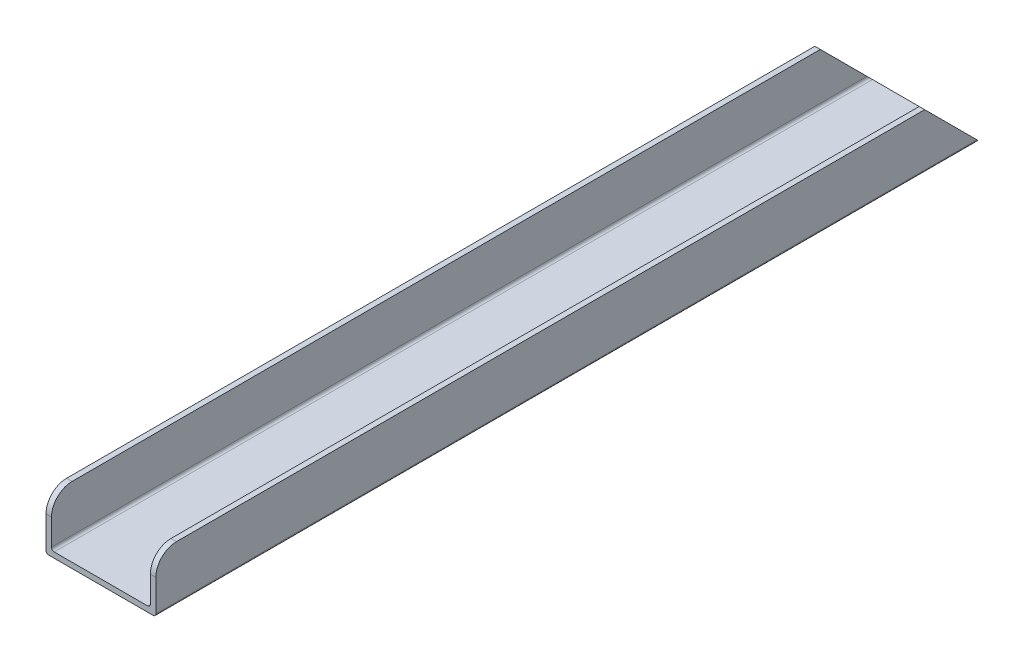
ISO-10303-21;
HEADER;
FILE_DESCRIPTION(('STEP AP214'),'2;1');
FILE_NAME('part.step','',(''),(''),'','','');
FILE_SCHEMA(('AUTOMOTIVE_DESIGN { 1 0 10303 214 1 1 1 1 }'));
ENDSEC;
DATA;
#1=APPLICATION_CONTEXT('core data for automotive mechanical design processes');
#2=APPLICATION_PROTOCOL_DEFINITION('international standard','automotive_design',2000,#1);
#3=PRODUCT_CONTEXT('',#1,'mechanical');
#4=PRODUCT('Part','Part','',(#3));
#5=PRODUCT_RELATED_PRODUCT_CATEGORY('part','',(#4));
#6=PRODUCT_DEFINITION_FORMATION('','',#4);
#7=PRODUCT_DEFINITION_CONTEXT('part definition',#1,'design');
#8=PRODUCT_DEFINITION('design','',#6,#7);
#9=PRODUCT_DEFINITION_SHAPE('','',#8);
#10=(LENGTH_UNIT() NAMED_UNIT(*) SI_UNIT(.MILLI.,.METRE.));
#11=(NAMED_UNIT(*) PLANE_ANGLE_UNIT() SI_UNIT($,.RADIAN.));
#12=(NAMED_UNIT(*) SI_UNIT($,.STERADIAN.) SOLID_ANGLE_UNIT());
#13=UNCERTAINTY_MEASURE_WITH_UNIT(LENGTH_MEASURE(1.E-05),#10,'distance_accuracy_value','');
#14=(GEOMETRIC_REPRESENTATION_CONTEXT(3) GLOBAL_UNCERTAINTY_ASSIGNED_CONTEXT((#13)) GLOBAL_UNIT_ASSIGNED_CONTEXT((#10,
#11,#12)) REPRESENTATION_CONTEXT('',''));
#15=CARTESIAN_POINT('',(0.,0.,0.));
#16=DIRECTION('',(0.,0.,1.));
#17=DIRECTION('',(1.,0.,0.));
#18=AXIS2_PLACEMENT_3D('',#15,#16,#17);
#19=CARTESIAN_POINT('',(40.,40.0000000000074,600.));
#20=DIRECTION('',(0.,-1.00000000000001,0.));
#21=DIRECTION('',(0.,0.,-1.));
#22=AXIS2_PLACEMENT_3D('',#19,#20,#21);
#23=PLANE('',#22);
#24=DIRECTION('',(0.,0.,-1.));
#25=VECTOR('',#24,1.);
#26=CARTESIAN_POINT('',(35.999999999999,40.0000000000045,600.));
#27=LINE('',#26,#25);
#28=CARTESIAN_POINT('',(35.9999999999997,40.0000000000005,585.));
#29=VERTEX_POINT('',#28);
#30=CARTESIAN_POINT('',(35.9999999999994,39.9999999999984,39.9999999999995));
#31=VERTEX_POINT('',#30);
#32=EDGE_CURVE('E281',#29,#31,#27,.T.);
#33=ORIENTED_EDGE('',*,*,#32,.F.);
#34=DIRECTION('',(-1.00000000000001,0.,0.));
#35=VECTOR('',#34,1.);
#36=CARTESIAN_POINT('',(40.,40.0000000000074,585.));
#37=LINE('',#36,#35);
#38=CARTESIAN_POINT('',(40.,40.0000000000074,585.));
#39=VERTEX_POINT('',#38);
#40=EDGE_CURVE('E60',#29,#39,#37,.F.);
#41=ORIENTED_EDGE('',*,*,#40,.T.);
#42=DIRECTION('',(0.,0.,-1.));
#43=VECTOR('',#42,1.);
#44=CARTESIAN_POINT('',(40.,40.0000000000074,600.));
#45=LINE('',#44,#43);
#46=CARTESIAN_POINT('',(40.,39.9999999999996,39.9999999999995));
#47=VERTEX_POINT('',#46);
#48=EDGE_CURVE('E164',#39,#47,#45,.T.);
#49=ORIENTED_EDGE('',*,*,#48,.T.);
#50=DIRECTION('',(1.00000000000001,0.,0.));
#51=VECTOR('',#50,1.);
#52=CARTESIAN_POINT('',(-893.28754440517,39.9999999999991,39.9999999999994));
#53=LINE('',#52,#51);
#54=EDGE_CURVE('E180',#31,#47,#53,.T.);
#55=ORIENTED_EDGE('',*,*,#54,.F.);
#56=EDGE_LOOP('',(#33,#41,#49,#55));
#57=FACE_BOUND('',#56,.T.);
#58=ADVANCED_FACE('F51',(#57),#23,.F.);
#59=CARTESIAN_POINT('',(-36.0000000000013,40.0000000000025,600.));
#60=DIRECTION('',(0.,-1.00000000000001,0.));
#61=DIRECTION('',(0.,0.,-1.));
#62=AXIS2_PLACEMENT_3D('',#59,#60,#61);
#63=PLANE('',#62);
#64=DIRECTION('',(0.,0.,-1.));
#65=VECTOR('',#64,1.);
#66=CARTESIAN_POINT('',(-40.0000000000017,40.0000000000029,600.));
#67=LINE('',#66,#65);
#68=CARTESIAN_POINT('',(-40.000000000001,40.0000000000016,585.));
#69=VERTEX_POINT('',#68);
#70=CARTESIAN_POINT('',(-40.0000000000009,39.9999999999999,39.9999999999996));
#71=VERTEX_POINT('',#70);
#72=EDGE_CURVE('E259',#69,#71,#67,.T.);
#73=ORIENTED_EDGE('',*,*,#72,.F.);
#74=DIRECTION('',(-1.00000000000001,0.,0.));
#75=VECTOR('',#74,1.);
#76=CARTESIAN_POINT('',(-36.0000000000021,40.0000000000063,585.));
#77=LINE('',#76,#75);
#78=CARTESIAN_POINT('',(-36.0000000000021,40.0000000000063,585.));
#79=VERTEX_POINT('',#78);
#80=EDGE_CURVE('E295',#69,#79,#77,.F.);
#81=ORIENTED_EDGE('',*,*,#80,.T.);
#82=DIRECTION('',(0.,0.,-1.));
#83=VECTOR('',#82,1.);
#84=CARTESIAN_POINT('',(-36.0000000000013,40.0000000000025,600.));
#85=LINE('',#84,#83);
#86=CARTESIAN_POINT('',(-36.0000000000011,40.0000000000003,39.9999999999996));
#87=VERTEX_POINT('',#86);
#88=EDGE_CURVE('E262',#79,#87,#85,.T.);
#89=ORIENTED_EDGE('',*,*,#88,.T.);
#90=EDGE_CURVE('E182',#71,#87,#53,.T.);
#91=ORIENTED_EDGE('',*,*,#90,.F.);
#92=EDGE_LOOP('',(#73,#81,#89,#91));
#93=FACE_BOUND('',#92,.T.);
#94=ADVANCED_FACE('F363',(#93),#63,.F.);
#95=CARTESIAN_POINT('',(35.999999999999,40.0000000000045,600.));
#96=DIRECTION('',(1.00000000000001,0.,0.));
#97=DIRECTION('',(0.,1.00000000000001,0.));
#98=AXIS2_PLACEMENT_3D('',#95,#96,#97);
#99=PLANE('',#98);
#100=DIRECTION('',(0.,-1.00000000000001,0.));
#101=VECTOR('',#100,1.);
#102=CARTESIAN_POINT('',(35.999999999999,40.0000000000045,600.));
#103=LINE('',#102,#101);
#104=CARTESIAN_POINT('',(35.9999999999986,25.000000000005,600.));
#105=VERTEX_POINT('',#104);
#106=CARTESIAN_POINT('',(36.,5.99999999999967,600.));
#107=VERTEX_POINT('',#106);
#108=EDGE_CURVE('E215',#105,#107,#103,.T.);
#109=ORIENTED_EDGE('',*,*,#108,.F.);
#110=CARTESIAN_POINT('',(35.9999999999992,25.0000000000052,585.));
#111=DIRECTION('',(1.00000000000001,0.,0.));
#112=DIRECTION('',(0.,1.00000000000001,0.));
#113=AXIS2_PLACEMENT_3D('',#110,#111,#112);
#114=CIRCLE('',#113,15.);
#115=EDGE_CURVE('E74',#105,#29,#114,.F.);
#116=ORIENTED_EDGE('',*,*,#115,.T.);
#117=ORIENTED_EDGE('',*,*,#32,.T.);
#118=DIRECTION('',(0.,0.707106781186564,0.707106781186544));
#119=VECTOR('',#118,1.);
#120=CARTESIAN_POINT('',(35.9999999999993,320.000000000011,319.999999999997));
#121=LINE('',#120,#119);
#122=CARTESIAN_POINT('',(36.,5.99999999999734,5.99999999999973));
#123=VERTEX_POINT('',#122);
#124=EDGE_CURVE('E211',#123,#31,#121,.T.);
#125=ORIENTED_EDGE('',*,*,#124,.F.);
#126=DIRECTION('',(0.,0.,-1.));
#127=VECTOR('',#126,1.);
#128=CARTESIAN_POINT('',(36.,5.99999999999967,600.));
#129=LINE('',#128,#127);
#130=EDGE_CURVE('E277',#107,#123,#129,.T.);
#131=ORIENTED_EDGE('',*,*,#130,.F.);
#132=EDGE_LOOP('',(#109,#116,#117,#125,#131));
#133=FACE_BOUND('',#132,.T.);
#134=ADVANCED_FACE('F386',(#133),#99,.F.);
#135=CARTESIAN_POINT('',(33.9999999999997,6.00000000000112,600.));
#136=DIRECTION('',(0.,0.,-1.));
#137=DIRECTION('',(-1.00000000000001,0.,0.));
#138=AXIS2_PLACEMENT_3D('',#135,#136,#137);
#139=CYLINDRICAL_SURFACE('',#138,2.);
#140=CARTESIAN_POINT('',(34.,5.99999999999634,5.99999999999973));
#141=DIRECTION('',(0.,0.707106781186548,-0.707106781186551));
#142=DIRECTION('',(0.,-0.707106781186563,-0.707106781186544));
#143=AXIS2_PLACEMENT_3D('',#140,#141,#142);
#144=ELLIPSE('',#143,2.82842712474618,2.);
#145=CARTESIAN_POINT('',(34.,4.,3.99999999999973));
#146=VERTEX_POINT('',#145);
#147=EDGE_CURVE('E208',#146,#123,#144,.F.);
#148=ORIENTED_EDGE('',*,*,#147,.F.);
#149=DIRECTION('',(0.,0.,-1.));
#150=VECTOR('',#149,1.);
#151=CARTESIAN_POINT('',(33.9999999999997,4.00000000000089,600.));
#152=LINE('',#151,#150);
#153=CARTESIAN_POINT('',(33.9999999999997,4.00000000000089,600.));
#154=VERTEX_POINT('',#153);
#155=EDGE_CURVE('E273',#154,#146,#152,.T.);
#156=ORIENTED_EDGE('',*,*,#155,.F.);
#157=CARTESIAN_POINT('',(33.9999999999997,6.00000000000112,600.));
#158=DIRECTION('',(0.,0.,-1.));
#159=DIRECTION('',(-1.00000000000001,0.,0.));
#160=AXIS2_PLACEMENT_3D('',#157,#158,#159);
#161=CIRCLE('',#160,2.);
#162=EDGE_CURVE('E218',#107,#154,#161,.T.);
#163=ORIENTED_EDGE('',*,*,#162,.F.);
#164=ORIENTED_EDGE('',*,*,#130,.T.);
#165=EDGE_LOOP('',(#148,#156,#163,#164));
#166=FACE_BOUND('',#165,.T.);
#167=ADVANCED_FACE('F416',(#166),#139,.F.);
#168=CARTESIAN_POINT('',(33.9999999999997,4.00000000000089,600.));
#169=DIRECTION('',(0.,-1.00000000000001,0.));
#170=DIRECTION('',(1.00000000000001,0.,0.));
#171=AXIS2_PLACEMENT_3D('',#168,#169,#170);
#172=PLANE('',#171);
#173=DIRECTION('',(1.00000000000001,0.,0.));
#174=VECTOR('',#173,1.);
#175=CARTESIAN_POINT('',(34.,4.,3.99999999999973));
#176=LINE('',#175,#174);
#177=CARTESIAN_POINT('',(-34.,4.00000000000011,3.99999999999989));
#178=VERTEX_POINT('',#177);
#179=EDGE_CURVE('E204',#178,#146,#176,.T.);
#180=ORIENTED_EDGE('',*,*,#179,.F.);
#181=DIRECTION('',(0.,0.,-1.));
#182=VECTOR('',#181,1.);
#183=CARTESIAN_POINT('',(-34.0000000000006,4.00000000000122,600.));
#184=LINE('',#183,#182);
#185=CARTESIAN_POINT('',(-34.0000000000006,4.00000000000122,600.));
#186=VERTEX_POINT('',#185);
#187=EDGE_CURVE('E269',#186,#178,#184,.T.);
#188=ORIENTED_EDGE('',*,*,#187,.F.);
#189=DIRECTION('',(-1.00000000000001,0.,0.));
#190=VECTOR('',#189,1.);
#191=CARTESIAN_POINT('',(33.9999999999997,4.00000000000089,600.));
#192=LINE('',#191,#190);
#193=EDGE_CURVE('E221',#154,#186,#192,.T.);
#194=ORIENTED_EDGE('',*,*,#193,.F.);
#195=ORIENTED_EDGE('',*,*,#155,.T.);
#196=EDGE_LOOP('',(#180,#188,#194,#195));
#197=FACE_BOUND('',#196,.T.);
#198=ADVANCED_FACE('F413',(#197),#172,.F.);
#199=CARTESIAN_POINT('',(-34.0000000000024,6.00000000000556,600.));
#200=DIRECTION('',(0.,0.,-1.));
#201=DIRECTION('',(-1.00000000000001,0.,0.));
#202=AXIS2_PLACEMENT_3D('',#199,#200,#201);
#203=CYLINDRICAL_SURFACE('',#202,2.);
#204=CARTESIAN_POINT('',(-34.0000000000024,6.00000000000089,5.99999999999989));
#205=DIRECTION('',(0.,0.707106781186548,-0.707106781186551));
#206=DIRECTION('',(0.,-0.707106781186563,-0.707106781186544));
#207=AXIS2_PLACEMENT_3D('',#204,#205,#206);
#208=ELLIPSE('',#207,2.82842712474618,2.);
#209=CARTESIAN_POINT('',(-36.0000000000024,6.00000000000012,5.99999999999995));
#210=VERTEX_POINT('',#209);
#211=EDGE_CURVE('E200',#210,#178,#208,.F.);
#212=ORIENTED_EDGE('',*,*,#211,.F.);
#213=DIRECTION('',(0.,0.,-1.));
#214=VECTOR('',#213,1.);
#215=CARTESIAN_POINT('',(-36.0000000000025,6.000000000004,600.));
#216=LINE('',#215,#214);
#217=CARTESIAN_POINT('',(-36.0000000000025,6.000000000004,600.));
#218=VERTEX_POINT('',#217);
#219=EDGE_CURVE('E265',#218,#210,#216,.T.);
#220=ORIENTED_EDGE('',*,*,#219,.F.);
#221=CARTESIAN_POINT('',(-34.0000000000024,6.00000000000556,600.));
#222=DIRECTION('',(0.,0.,-1.));
#223=DIRECTION('',(-1.00000000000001,0.,0.));
#224=AXIS2_PLACEMENT_3D('',#221,#222,#223);
#225=CIRCLE('',#224,2.);
#226=EDGE_CURVE('E224',#186,#218,#225,.T.);
#227=ORIENTED_EDGE('',*,*,#226,.F.);
#228=ORIENTED_EDGE('',*,*,#187,.T.);
#229=EDGE_LOOP('',(#212,#220,#227,#228));
#230=FACE_BOUND('',#229,.T.);
#231=ADVANCED_FACE('F410',(#230),#203,.F.);
#232=CARTESIAN_POINT('',(-36.0000000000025,6.000000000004,600.));
#233=DIRECTION('',(-1.00000000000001,0.,0.));
#234=DIRECTION('',(0.,-1.00000000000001,0.));
#235=AXIS2_PLACEMENT_3D('',#232,#233,#234);
#236=PLANE('',#235);
#237=ORIENTED_EDGE('',*,*,#88,.F.);
#238=CARTESIAN_POINT('',(-36.0000000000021,25.0000000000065,585.));
#239=DIRECTION('',(-1.00000000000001,0.,0.));
#240=DIRECTION('',(0.,-1.00000000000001,0.));
#241=AXIS2_PLACEMENT_3D('',#238,#239,#240);
#242=CIRCLE('',#241,15.);
#243=CARTESIAN_POINT('',(-36.0000000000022,25.000000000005,600.));
#244=VERTEX_POINT('',#243);
#245=EDGE_CURVE('E298',#79,#244,#242,.F.);
#246=ORIENTED_EDGE('',*,*,#245,.T.);
#247=DIRECTION('',(0.,1.00000000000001,0.));
#248=VECTOR('',#247,1.);
#249=CARTESIAN_POINT('',(-36.0000000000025,6.000000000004,600.));
#250=LINE('',#249,#248);
#251=EDGE_CURVE('E227',#218,#244,#250,.T.);
#252=ORIENTED_EDGE('',*,*,#251,.F.);
#253=ORIENTED_EDGE('',*,*,#219,.T.);
#254=DIRECTION('',(0.,-0.707106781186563,-0.707106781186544));
#255=VECTOR('',#254,1.);
#256=CARTESIAN_POINT('',(-36.0000000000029,303.000000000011,302.999999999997));
#257=LINE('',#256,#255);
#258=EDGE_CURVE('E196',#87,#210,#257,.T.);
#259=ORIENTED_EDGE('',*,*,#258,.F.);
#260=EDGE_LOOP('',(#237,#246,#252,#253,#259));
#261=FACE_BOUND('',#260,.T.);
#262=ADVANCED_FACE('F346',(#261),#236,.F.);
#263=CARTESIAN_POINT('',(-40.0000000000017,40.0000000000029,600.));
#264=DIRECTION('',(1.00000000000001,0.,0.));
#265=DIRECTION('',(0.,0.,-1.));
#266=AXIS2_PLACEMENT_3D('',#263,#264,#265);
#267=PLANE('',#266);
#268=DIRECTION('',(0.,-1.00000000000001,0.));
#269=VECTOR('',#268,1.);
#270=CARTESIAN_POINT('',(-40.0000000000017,40.0000000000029,600.));
#271=LINE('',#270,#269);
#272=CARTESIAN_POINT('',(-40.000000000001,25.0000000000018,600.));
#273=VERTEX_POINT('',#272);
#274=CARTESIAN_POINT('',(-40.0000000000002,2.00000000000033,600.));
#275=VERTEX_POINT('',#274);
#276=EDGE_CURVE('E231',#273,#275,#271,.T.);
#277=ORIENTED_EDGE('',*,*,#276,.F.);
#278=CARTESIAN_POINT('',(-40.0000000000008,25.0000000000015,585.));
#279=DIRECTION('',(1.00000000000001,0.,0.));
#280=DIRECTION('',(0.,0.,-1.));
#281=AXIS2_PLACEMENT_3D('',#278,#279,#280);
#282=CIRCLE('',#281,15.);
#283=EDGE_CURVE('E292',#273,#69,#282,.F.);
#284=ORIENTED_EDGE('',*,*,#283,.T.);
#285=ORIENTED_EDGE('',*,*,#72,.T.);
#286=DIRECTION('',(0.,0.707106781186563,0.707106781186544));
#287=VECTOR('',#286,1.);
#288=CARTESIAN_POINT('',(-40.000000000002,320.000000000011,319.999999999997));
#289=LINE('',#288,#287);
#290=CARTESIAN_POINT('',(-40.0000000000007,2.00000000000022,1.99999999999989));
#291=VERTEX_POINT('',#290);
#292=EDGE_CURVE('E192',#291,#71,#289,.T.);
#293=ORIENTED_EDGE('',*,*,#292,.F.);
#294=DIRECTION('',(0.,0.,-1.));
#295=VECTOR('',#294,1.);
#296=CARTESIAN_POINT('',(-40.0000000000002,2.00000000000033,600.));
#297=LINE('',#296,#295);
#298=EDGE_CURVE('E255',#275,#291,#297,.T.);
#299=ORIENTED_EDGE('',*,*,#298,.F.);
#300=EDGE_LOOP('',(#277,#284,#285,#293,#299));
#301=FACE_BOUND('',#300,.T.);
#302=ADVANCED_FACE('F359',(#301),#267,.F.);
#303=CARTESIAN_POINT('',(-38.0000000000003,2.00000000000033,600.));
#304=DIRECTION('',(0.,0.,-1.));
#305=DIRECTION('',(-1.00000000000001,0.,0.));
#306=AXIS2_PLACEMENT_3D('',#303,#304,#305);
#307=CYLINDRICAL_SURFACE('',#306,2.);
#308=CARTESIAN_POINT('',(-38.0000000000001,2.00000000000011,1.99999999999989));
#309=DIRECTION('',(0.,0.707106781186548,-0.707106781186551));
#310=DIRECTION('',(0.,-0.707106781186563,-0.707106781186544));
#311=AXIS2_PLACEMENT_3D('',#308,#309,#310);
#312=ELLIPSE('',#311,2.82842712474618,2.);
#313=CARTESIAN_POINT('',(-38.0000000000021,1.11022302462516E-12,0.));
#314=VERTEX_POINT('',#313);
#315=EDGE_CURVE('E174',#314,#291,#312,.T.);
#316=ORIENTED_EDGE('',*,*,#315,.F.);
#317=DIRECTION('',(0.,0.,-1.));
#318=VECTOR('',#317,1.);
#319=CARTESIAN_POINT('',(-38.0000000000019,4.44089209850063E-12,600.));
#320=LINE('',#319,#318);
#321=CARTESIAN_POINT('',(-38.0000000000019,4.44089209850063E-12,600.));
#322=VERTEX_POINT('',#321);
#323=EDGE_CURVE('E251',#322,#314,#320,.T.);
#324=ORIENTED_EDGE('',*,*,#323,.F.);
#325=CARTESIAN_POINT('',(-38.0000000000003,2.00000000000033,600.));
#326=DIRECTION('',(0.,0.,1.));
#327=DIRECTION('',(-1.00000000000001,0.,0.));
#328=AXIS2_PLACEMENT_3D('',#325,#326,#327);
#329=CIRCLE('',#328,2.);
#330=EDGE_CURVE('E234',#275,#322,#329,.T.);
#331=ORIENTED_EDGE('',*,*,#330,.F.);
#332=ORIENTED_EDGE('',*,*,#298,.T.);
#333=EDGE_LOOP('',(#316,#324,#331,#332));
#334=FACE_BOUND('',#333,.T.);
#335=ADVANCED_FACE('F366',(#334),#307,.T.);
#336=CARTESIAN_POINT('',(37.9999999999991,2.00000000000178,600.));
#337=DIRECTION('',(0.,0.,-1.));
#338=DIRECTION('',(-1.00000000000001,0.,0.));
#339=AXIS2_PLACEMENT_3D('',#336,#337,#338);
#340=CYLINDRICAL_SURFACE('',#339,2.);
#341=CARTESIAN_POINT('',(38.,2.00000000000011,1.99999999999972));
#342=DIRECTION('',(0.,0.707106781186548,-0.707106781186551));
#343=DIRECTION('',(0.,-0.707106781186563,-0.707106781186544));
#344=AXIS2_PLACEMENT_3D('',#341,#342,#343);
#345=ELLIPSE('',#344,2.82842712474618,2.);
#346=CARTESIAN_POINT('',(40.,2.00000000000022,1.99999999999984));
#347=VERTEX_POINT('',#346);
#348=CARTESIAN_POINT('',(38.,0.,-1.66533453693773E-13));
#349=VERTEX_POINT('',#348);
#350=EDGE_CURVE('E168',#347,#349,#345,.T.);
#351=ORIENTED_EDGE('',*,*,#350,.F.);
#352=DIRECTION('',(0.,0.,-1.));
#353=VECTOR('',#352,1.);
#354=CARTESIAN_POINT('',(39.9999999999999,2.00000000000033,600.));
#355=LINE('',#354,#353);
#356=CARTESIAN_POINT('',(39.9999999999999,2.00000000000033,600.));
#357=VERTEX_POINT('',#356);
#358=EDGE_CURVE('E152',#357,#347,#355,.T.);
#359=ORIENTED_EDGE('',*,*,#358,.F.);
#360=CARTESIAN_POINT('',(37.9999999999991,2.00000000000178,600.));
#361=DIRECTION('',(0.,0.,1.));
#362=DIRECTION('',(1.00000000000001,0.,0.));
#363=AXIS2_PLACEMENT_3D('',#360,#361,#362);
#364=CIRCLE('',#363,2.);
#365=CARTESIAN_POINT('',(38.,2.22044604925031E-13,600.));
#366=VERTEX_POINT('',#365);
#367=EDGE_CURVE('E240',#366,#357,#364,.T.);
#368=ORIENTED_EDGE('',*,*,#367,.F.);
#369=DIRECTION('',(0.,0.,-1.));
#370=VECTOR('',#369,1.);
#371=CARTESIAN_POINT('',(38.,2.22044604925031E-13,600.));
#372=LINE('',#371,#370);
#373=EDGE_CURVE('E163',#366,#349,#372,.T.);
#374=ORIENTED_EDGE('',*,*,#373,.T.);
#375=EDGE_LOOP('',(#351,#359,#368,#374));
#376=FACE_BOUND('',#375,.T.);
#377=ADVANCED_FACE('F169',(#376),#340,.T.);
#378=CARTESIAN_POINT('',(39.9999999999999,2.00000000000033,600.));
#379=DIRECTION('',(-1.00000000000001,0.,0.));
#380=DIRECTION('',(0.,0.,1.));
#381=AXIS2_PLACEMENT_3D('',#378,#379,#380);
#382=PLANE('',#381);
#383=ORIENTED_EDGE('',*,*,#48,.F.);
#384=CARTESIAN_POINT('',(39.9999999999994,25.0000000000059,585.));
#385=DIRECTION('',(-1.00000000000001,0.,0.));
#386=DIRECTION('',(0.,0.,1.));
#387=AXIS2_PLACEMENT_3D('',#384,#385,#386);
#388=CIRCLE('',#387,15.);
#389=CARTESIAN_POINT('',(39.9999999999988,25.0000000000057,600.));
#390=VERTEX_POINT('',#389);
#391=EDGE_CURVE('E13',#39,#390,#388,.F.);
#392=ORIENTED_EDGE('',*,*,#391,.T.);
#393=DIRECTION('',(0.,1.00000000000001,0.));
#394=VECTOR('',#393,1.);
#395=CARTESIAN_POINT('',(39.9999999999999,2.00000000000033,600.));
#396=LINE('',#395,#394);
#397=EDGE_CURVE('E159',#357,#390,#396,.T.);
#398=ORIENTED_EDGE('',*,*,#397,.F.);
#399=ORIENTED_EDGE('',*,*,#358,.T.);
#400=DIRECTION('',(0.,-0.707106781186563,-0.707106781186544));
#401=VECTOR('',#400,1.);
#402=CARTESIAN_POINT('',(39.9999999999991,301.00000000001,300.999999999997));
#403=LINE('',#402,#401);
#404=EDGE_CURVE('E156',#47,#347,#403,.T.);
#405=ORIENTED_EDGE('',*,*,#404,.F.);
#406=EDGE_LOOP('',(#383,#392,#398,#399,#405));
#407=FACE_BOUND('',#406,.T.);
#408=ADVANCED_FACE('F154',(#407),#382,.F.);
#409=CARTESIAN_POINT('',(-38.0000000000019,4.44089209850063E-12,600.));
#410=DIRECTION('',(0.,1.00000000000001,0.));
#411=DIRECTION('',(0.,0.,1.));
#412=AXIS2_PLACEMENT_3D('',#409,#410,#411);
#413=PLANE('',#412);
#414=DIRECTION('',(1.00000000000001,0.,0.));
#415=VECTOR('',#414,1.);
#416=CARTESIAN_POINT('',(-38.0000000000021,1.11022302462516E-12,0.));
#417=LINE('',#416,#415);
#418=EDGE_CURVE('E214',#314,#349,#417,.T.);
#419=ORIENTED_EDGE('',*,*,#418,.T.);
#420=ORIENTED_EDGE('',*,*,#373,.F.);
#421=DIRECTION('',(1.00000000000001,0.,0.));
#422=VECTOR('',#421,1.);
#423=CARTESIAN_POINT('',(-38.0000000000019,4.44089209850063E-12,600.));
#424=LINE('',#423,#422);
#425=EDGE_CURVE('E237',#322,#366,#424,.T.);
#426=ORIENTED_EDGE('',*,*,#425,.F.);
#427=ORIENTED_EDGE('',*,*,#323,.T.);
#428=EDGE_LOOP('',(#419,#420,#426,#427));
#429=FACE_BOUND('',#428,.T.);
#430=ADVANCED_FACE('F370',(#429),#413,.F.);
#431=CARTESIAN_POINT('',(33.9999999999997,6.00000000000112,600.));
#432=DIRECTION('',(0.,0.,-1.));
#433=DIRECTION('',(-1.00000000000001,0.,0.));
#434=AXIS2_PLACEMENT_3D('',#431,#432,#433);
#435=PLANE('',#434);
#436=ORIENTED_EDGE('',*,*,#251,.T.);
#437=DIRECTION('',(-1.00000000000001,0.,0.));
#438=VECTOR('',#437,1.);
#439=CARTESIAN_POINT('',(33.9999999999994,25.0000000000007,600.));
#440=LINE('',#439,#438);
#441=EDGE_CURVE('E288',#244,#273,#440,.T.);
#442=ORIENTED_EDGE('',*,*,#441,.T.);
#443=ORIENTED_EDGE('',*,*,#276,.T.);
#444=ORIENTED_EDGE('',*,*,#330,.T.);
#445=ORIENTED_EDGE('',*,*,#425,.T.);
#446=ORIENTED_EDGE('',*,*,#367,.T.);
#447=ORIENTED_EDGE('',*,*,#397,.T.);
#448=DIRECTION('',(-1.00000000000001,0.,0.));
#449=VECTOR('',#448,1.);
#450=CARTESIAN_POINT('',(33.9999999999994,25.0000000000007,600.));
#451=LINE('',#450,#449);
#452=EDGE_CURVE('E284',#390,#105,#451,.T.);
#453=ORIENTED_EDGE('',*,*,#452,.T.);
#454=ORIENTED_EDGE('',*,*,#108,.T.);
#455=ORIENTED_EDGE('',*,*,#162,.T.);
#456=ORIENTED_EDGE('',*,*,#193,.T.);
#457=ORIENTED_EDGE('',*,*,#226,.T.);
#458=EDGE_LOOP('',(#436,#442,#443,#444,#445,#446,#447,#453,#454,#455,#456,#457));
#459=FACE_BOUND('',#458,.T.);
#460=ADVANCED_FACE('F352',(#459),#435,.F.);
#461=CARTESIAN_POINT('',(-893.287544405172,-4.44089209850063E-13,-1.66533453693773E-13));
#462=DIRECTION('',(0.,0.707106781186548,-0.707106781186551));
#463=DIRECTION('',(0.,0.707106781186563,0.707106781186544));
#464=AXIS2_PLACEMENT_3D('',#461,#462,#463);
#465=PLANE('',#464);
#466=ORIENTED_EDGE('',*,*,#147,.T.);
#467=ORIENTED_EDGE('',*,*,#124,.T.);
#468=ORIENTED_EDGE('',*,*,#54,.T.);
#469=ORIENTED_EDGE('',*,*,#404,.T.);
#470=ORIENTED_EDGE('',*,*,#350,.T.);
#471=ORIENTED_EDGE('',*,*,#418,.F.);
#472=ORIENTED_EDGE('',*,*,#315,.T.);
#473=ORIENTED_EDGE('',*,*,#292,.T.);
#474=ORIENTED_EDGE('',*,*,#90,.T.);
#475=ORIENTED_EDGE('',*,*,#258,.T.);
#476=ORIENTED_EDGE('',*,*,#211,.T.);
#477=ORIENTED_EDGE('',*,*,#179,.T.);
#478=EDGE_LOOP('',(#466,#467,#468,#469,#470,#471,#472,#473,#474,#475,#476,#477));
#479=FACE_BOUND('',#478,.T.);
#480=ADVANCED_FACE('F177',(#479),#465,.T.);
#481=CARTESIAN_POINT('',(33.9999999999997,25.0000000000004,585.));
#482=DIRECTION('',(-1.00000000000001,0.,0.));
#483=DIRECTION('',(0.,0.,1.));
#484=AXIS2_PLACEMENT_3D('',#481,#482,#483);
#485=CYLINDRICAL_SURFACE('',#484,15.);
#486=ORIENTED_EDGE('',*,*,#245,.F.);
#487=ORIENTED_EDGE('',*,*,#80,.F.);
#488=ORIENTED_EDGE('',*,*,#283,.F.);
#489=ORIENTED_EDGE('',*,*,#441,.F.);
#490=EDGE_LOOP('',(#486,#487,#488,#489));
#491=FACE_BOUND('',#490,.T.);
#492=ADVANCED_FACE('F356',(#491),#485,.T.);
#493=CARTESIAN_POINT('',(33.9999999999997,25.0000000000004,585.));
#494=DIRECTION('',(-1.00000000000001,0.,0.));
#495=DIRECTION('',(0.,0.,1.));
#496=AXIS2_PLACEMENT_3D('',#493,#494,#495);
#497=CYLINDRICAL_SURFACE('',#496,15.);
#498=ORIENTED_EDGE('',*,*,#391,.F.);
#499=ORIENTED_EDGE('',*,*,#40,.F.);
#500=ORIENTED_EDGE('',*,*,#115,.F.);
#501=ORIENTED_EDGE('',*,*,#452,.F.);
#502=EDGE_LOOP('',(#498,#499,#500,#501));
#503=FACE_BOUND('',#502,.T.);
#504=ADVANCED_FACE('F53',(#503),#497,.T.);
#505=CLOSED_SHELL('',(#58,#94,#134,#167,#198,#231,#262,#302,#335,#377,#408,#430,#460,#480,#492,#504));
#506=MANIFOLD_SOLID_BREP('B2',#505);
#507=ADVANCED_BREP_SHAPE_REPRESENTATION('',(#18,#506),#14);
#508=SHAPE_DEFINITION_REPRESENTATION(#9,#507);
ENDSEC;
END-ISO-10303-21;
